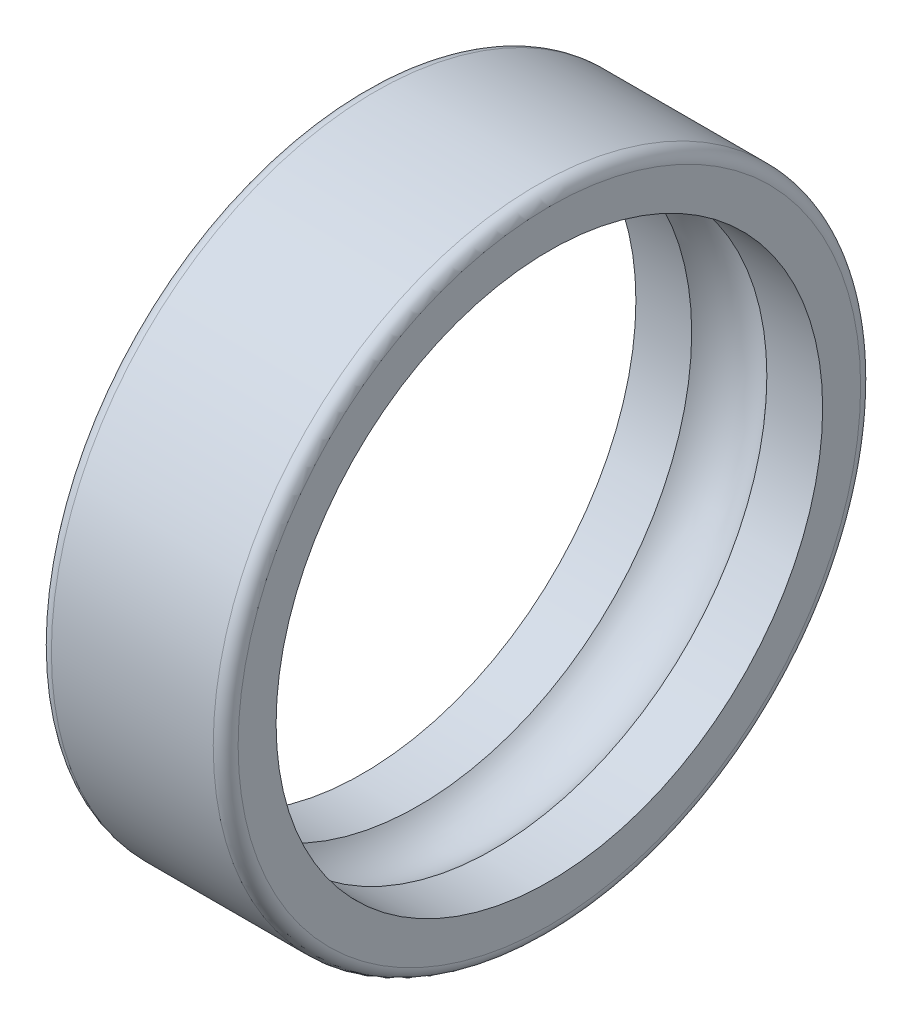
ISO-10303-21;
HEADER;
FILE_DESCRIPTION(('STEP AP214'),'2;1');
FILE_NAME('part.step','',(''),(''),'','','');
FILE_SCHEMA(('AUTOMOTIVE_DESIGN { 1 0 10303 214 1 1 1 1 }'));
ENDSEC;
DATA;
#1=APPLICATION_CONTEXT('core data for automotive mechanical design processes');
#2=APPLICATION_PROTOCOL_DEFINITION('international standard','automotive_design',2000,#1);
#3=PRODUCT_CONTEXT('',#1,'mechanical');
#4=PRODUCT('Part','Part','',(#3));
#5=PRODUCT_RELATED_PRODUCT_CATEGORY('part','',(#4));
#6=PRODUCT_DEFINITION_FORMATION('','',#4);
#7=PRODUCT_DEFINITION_CONTEXT('part definition',#1,'design');
#8=PRODUCT_DEFINITION('design','',#6,#7);
#9=PRODUCT_DEFINITION_SHAPE('','',#8);
#10=(LENGTH_UNIT() NAMED_UNIT(*) SI_UNIT(.MILLI.,.METRE.));
#11=(NAMED_UNIT(*) PLANE_ANGLE_UNIT() SI_UNIT($,.RADIAN.));
#12=(NAMED_UNIT(*) SI_UNIT($,.STERADIAN.) SOLID_ANGLE_UNIT());
#13=UNCERTAINTY_MEASURE_WITH_UNIT(LENGTH_MEASURE(1.E-05),#10,'distance_accuracy_value','');
#14=(GEOMETRIC_REPRESENTATION_CONTEXT(3) GLOBAL_UNCERTAINTY_ASSIGNED_CONTEXT((#13)) GLOBAL_UNIT_ASSIGNED_CONTEXT((#10,
#11,#12)) REPRESENTATION_CONTEXT('',''));
#15=CARTESIAN_POINT('',(0.,0.,0.));
#16=DIRECTION('',(0.,0.,1.));
#17=DIRECTION('',(1.,0.,0.));
#18=AXIS2_PLACEMENT_3D('',#15,#16,#17);
#19=CARTESIAN_POINT('',(1.,0.,0.));
#20=DIRECTION('',(-1.,0.,0.));
#21=DIRECTION('',(0.,0.,1.));
#22=AXIS2_PLACEMENT_3D('',#19,#20,#21);
#23=TOROIDAL_SURFACE('',#22,25.,1.);
#24=CARTESIAN_POINT('',(0.,0.,0.));
#25=DIRECTION('',(-1.,0.,0.));
#26=DIRECTION('',(0.,0.,1.));
#27=AXIS2_PLACEMENT_3D('',#24,#25,#26);
#28=CIRCLE('',#27,25.);
#29=CARTESIAN_POINT('',(0.,0.,25.));
#30=VERTEX_POINT('',#29);
#31=EDGE_CURVE('E10',#30,#30,#28,.T.);
#32=ORIENTED_EDGE('',*,*,#31,.F.);
#33=EDGE_LOOP('',(#32));
#34=FACE_BOUND('',#33,.T.);
#35=CARTESIAN_POINT('',(1.,0.,0.));
#36=DIRECTION('',(-1.,0.,0.));
#37=DIRECTION('',(0.,0.,1.));
#38=AXIS2_PLACEMENT_3D('',#35,#36,#37);
#39=CIRCLE('',#38,26.);
#40=CARTESIAN_POINT('',(1.,0.,26.));
#41=VERTEX_POINT('',#40);
#42=EDGE_CURVE('E53',#41,#41,#39,.T.);
#43=ORIENTED_EDGE('',*,*,#42,.T.);
#44=EDGE_LOOP('',(#43));
#45=FACE_BOUND('',#44,.T.);
#46=ADVANCED_FACE('F25',(#34,#45),#23,.T.);
#47=CARTESIAN_POINT('',(0.,0.,-25.));
#48=DIRECTION('',(1.,0.,0.));
#49=DIRECTION('',(0.,0.,-1.));
#50=AXIS2_PLACEMENT_3D('',#47,#48,#49);
#51=PLANE('',#50);
#52=CARTESIAN_POINT('',(0.,0.,0.));
#53=DIRECTION('',(-1.,0.,0.));
#54=DIRECTION('',(0.,0.,1.));
#55=AXIS2_PLACEMENT_3D('',#52,#53,#54);
#56=CIRCLE('',#55,21.95);
#57=CARTESIAN_POINT('',(0.,0.,21.95));
#58=VERTEX_POINT('',#57);
#59=EDGE_CURVE('E31',#58,#58,#56,.T.);
#60=ORIENTED_EDGE('',*,*,#59,.F.);
#61=EDGE_LOOP('',(#60));
#62=FACE_BOUND('',#61,.T.);
#63=ORIENTED_EDGE('',*,*,#31,.T.);
#64=EDGE_LOOP('',(#63));
#65=FACE_BOUND('',#64,.T.);
#66=ADVANCED_FACE('F90',(#62,#65),#51,.F.);
#67=CARTESIAN_POINT('',(0.,0.,0.));
#68=DIRECTION('',(-1.,0.,0.));
#69=DIRECTION('',(0.,0.,1.));
#70=AXIS2_PLACEMENT_3D('',#67,#68,#69);
#71=CYLINDRICAL_SURFACE('',#70,21.95);
#72=CARTESIAN_POINT('',(4.48130823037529,0.,0.));
#73=DIRECTION('',(-1.,0.,0.));
#74=DIRECTION('',(0.,0.,1.));
#75=AXIS2_PLACEMENT_3D('',#72,#73,#74);
#76=CIRCLE('',#75,21.95);
#77=CARTESIAN_POINT('',(4.48130823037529,0.,21.95));
#78=VERTEX_POINT('',#77);
#79=EDGE_CURVE('E35',#78,#78,#76,.T.);
#80=ORIENTED_EDGE('',*,*,#79,.F.);
#81=EDGE_LOOP('',(#80));
#82=FACE_BOUND('',#81,.T.);
#83=ORIENTED_EDGE('',*,*,#59,.T.);
#84=EDGE_LOOP('',(#83));
#85=FACE_BOUND('',#84,.T.);
#86=ADVANCED_FACE('F85',(#82,#85),#71,.F.);
#87=CARTESIAN_POINT('',(7.50000000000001,0.,0.));
#88=DIRECTION('',(-1.,0.,0.));
#89=DIRECTION('',(0.,0.,1.));
#90=AXIS2_PLACEMENT_3D('',#87,#88,#89);
#91=TOROIDAL_SURFACE('',#90,19.25,4.05);
#92=CARTESIAN_POINT('',(10.5186917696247,0.,0.));
#93=DIRECTION('',(-1.,0.,0.));
#94=DIRECTION('',(0.,0.,1.));
#95=AXIS2_PLACEMENT_3D('',#92,#93,#94);
#96=CIRCLE('',#95,21.95);
#97=CARTESIAN_POINT('',(10.5186917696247,0.,21.95));
#98=VERTEX_POINT('',#97);
#99=EDGE_CURVE('E39',#98,#98,#96,.T.);
#100=ORIENTED_EDGE('',*,*,#99,.F.);
#101=EDGE_LOOP('',(#100));
#102=FACE_BOUND('',#101,.T.);
#103=ORIENTED_EDGE('',*,*,#79,.T.);
#104=EDGE_LOOP('',(#103));
#105=FACE_BOUND('',#104,.T.);
#106=ADVANCED_FACE('F79',(#102,#105),#91,.F.);
#107=CARTESIAN_POINT('',(0.,0.,0.));
#108=DIRECTION('',(-1.,0.,0.));
#109=DIRECTION('',(0.,0.,1.));
#110=AXIS2_PLACEMENT_3D('',#107,#108,#109);
#111=CYLINDRICAL_SURFACE('',#110,21.95);
#112=CARTESIAN_POINT('',(15.,0.,0.));
#113=DIRECTION('',(-1.,0.,0.));
#114=DIRECTION('',(0.,0.,1.));
#115=AXIS2_PLACEMENT_3D('',#112,#113,#114);
#116=CIRCLE('',#115,21.95);
#117=CARTESIAN_POINT('',(15.,0.,21.95));
#118=VERTEX_POINT('',#117);
#119=EDGE_CURVE('E44',#118,#118,#116,.T.);
#120=ORIENTED_EDGE('',*,*,#119,.F.);
#121=EDGE_LOOP('',(#120));
#122=FACE_BOUND('',#121,.T.);
#123=ORIENTED_EDGE('',*,*,#99,.T.);
#124=EDGE_LOOP('',(#123));
#125=FACE_BOUND('',#124,.T.);
#126=ADVANCED_FACE('F73',(#122,#125),#111,.F.);
#127=CARTESIAN_POINT('',(15.,0.,-25.));
#128=DIRECTION('',(-1.,0.,0.));
#129=DIRECTION('',(0.,0.,1.));
#130=AXIS2_PLACEMENT_3D('',#127,#128,#129);
#131=PLANE('',#130);
#132=CARTESIAN_POINT('',(15.,0.,0.));
#133=DIRECTION('',(-1.,0.,0.));
#134=DIRECTION('',(0.,0.,1.));
#135=AXIS2_PLACEMENT_3D('',#132,#133,#134);
#136=CIRCLE('',#135,25.);
#137=CARTESIAN_POINT('',(15.,0.,25.));
#138=VERTEX_POINT('',#137);
#139=EDGE_CURVE('E47',#138,#138,#136,.T.);
#140=ORIENTED_EDGE('',*,*,#139,.F.);
#141=EDGE_LOOP('',(#140));
#142=FACE_BOUND('',#141,.T.);
#143=ORIENTED_EDGE('',*,*,#119,.T.);
#144=EDGE_LOOP('',(#143));
#145=FACE_BOUND('',#144,.T.);
#146=ADVANCED_FACE('F67',(#142,#145),#131,.F.);
#147=CARTESIAN_POINT('',(14.,0.,0.));
#148=DIRECTION('',(-1.,0.,0.));
#149=DIRECTION('',(0.,0.,1.));
#150=AXIS2_PLACEMENT_3D('',#147,#148,#149);
#151=TOROIDAL_SURFACE('',#150,25.,1.);
#152=CARTESIAN_POINT('',(14.,0.,0.));
#153=DIRECTION('',(-1.,0.,0.));
#154=DIRECTION('',(0.,0.,1.));
#155=AXIS2_PLACEMENT_3D('',#152,#153,#154);
#156=CIRCLE('',#155,26.);
#157=CARTESIAN_POINT('',(14.,0.,26.));
#158=VERTEX_POINT('',#157);
#159=EDGE_CURVE('E50',#158,#158,#156,.T.);
#160=ORIENTED_EDGE('',*,*,#159,.F.);
#161=EDGE_LOOP('',(#160));
#162=FACE_BOUND('',#161,.T.);
#163=ORIENTED_EDGE('',*,*,#139,.T.);
#164=EDGE_LOOP('',(#163));
#165=FACE_BOUND('',#164,.T.);
#166=ADVANCED_FACE('F61',(#162,#165),#151,.T.);
#167=CARTESIAN_POINT('',(0.,0.,0.));
#168=DIRECTION('',(-1.,0.,0.));
#169=DIRECTION('',(0.,0.,1.));
#170=AXIS2_PLACEMENT_3D('',#167,#168,#169);
#171=CYLINDRICAL_SURFACE('',#170,26.);
#172=ORIENTED_EDGE('',*,*,#42,.F.);
#173=EDGE_LOOP('',(#172));
#174=FACE_BOUND('',#173,.T.);
#175=ORIENTED_EDGE('',*,*,#159,.T.);
#176=EDGE_LOOP('',(#175));
#177=FACE_BOUND('',#176,.T.);
#178=ADVANCED_FACE('F58',(#174,#177),#171,.T.);
#179=CLOSED_SHELL('',(#46,#66,#86,#106,#126,#146,#166,#178));
#180=MANIFOLD_SOLID_BREP('B2',#179);
#181=ADVANCED_BREP_SHAPE_REPRESENTATION('',(#18,#180),#14);
#182=SHAPE_DEFINITION_REPRESENTATION(#9,#181);
ENDSEC;
END-ISO-10303-21;
